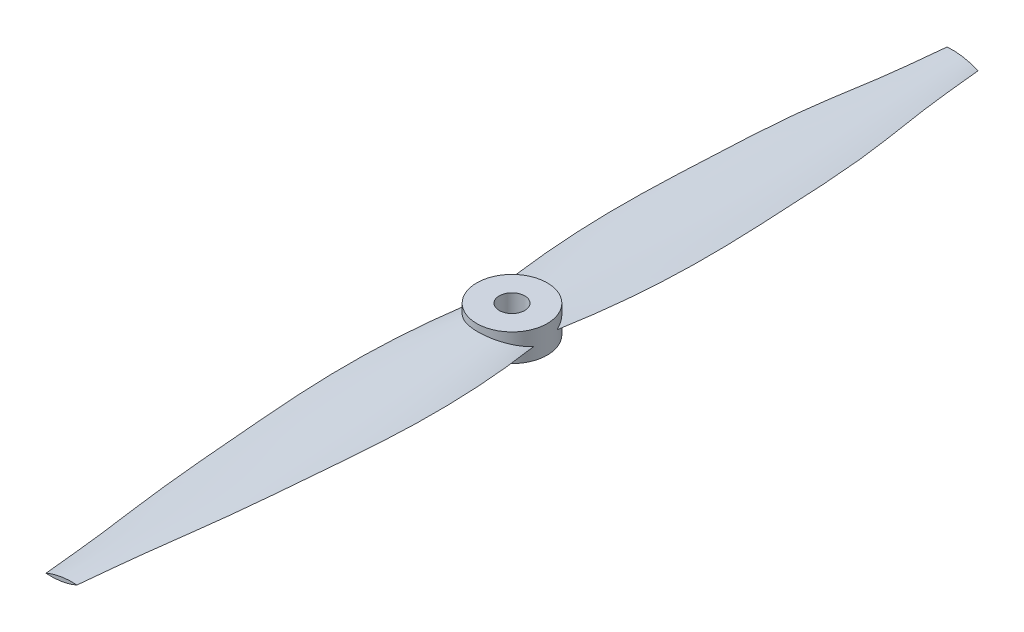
ISO-10303-21;
HEADER;
FILE_DESCRIPTION(('STEP AP214'),'2;1');
FILE_NAME('part.step','',(''),(''),'','','');
FILE_SCHEMA(('AUTOMOTIVE_DESIGN { 1 0 10303 214 1 1 1 1 }'));
ENDSEC;
DATA;
#1=APPLICATION_CONTEXT('core data for automotive mechanical design processes');
#2=APPLICATION_PROTOCOL_DEFINITION('international standard','automotive_design',2000,#1);
#3=PRODUCT_CONTEXT('',#1,'mechanical');
#4=PRODUCT('Part','Part','',(#3));
#5=PRODUCT_RELATED_PRODUCT_CATEGORY('part','',(#4));
#6=PRODUCT_DEFINITION_FORMATION('','',#4);
#7=PRODUCT_DEFINITION_CONTEXT('part definition',#1,'design');
#8=PRODUCT_DEFINITION('design','',#6,#7);
#9=PRODUCT_DEFINITION_SHAPE('','',#8);
#10=(LENGTH_UNIT() NAMED_UNIT(*) SI_UNIT(.MILLI.,.METRE.));
#11=(NAMED_UNIT(*) PLANE_ANGLE_UNIT() SI_UNIT($,.RADIAN.));
#12=(NAMED_UNIT(*) SI_UNIT($,.STERADIAN.) SOLID_ANGLE_UNIT());
#13=UNCERTAINTY_MEASURE_WITH_UNIT(LENGTH_MEASURE(1.E-05),#10,'distance_accuracy_value','');
#14=(GEOMETRIC_REPRESENTATION_CONTEXT(3) GLOBAL_UNCERTAINTY_ASSIGNED_CONTEXT((#13)) GLOBAL_UNIT_ASSIGNED_CONTEXT((#10,
#11,#12)) REPRESENTATION_CONTEXT('',''));
#15=CARTESIAN_POINT('',(0.,0.,0.));
#16=DIRECTION('',(0.,0.,1.));
#17=DIRECTION('',(1.,0.,0.));
#18=AXIS2_PLACEMENT_3D('',#15,#16,#17);
#19=CARTESIAN_POINT('',(0.,3.5,0.));
#20=DIRECTION('',(0.,-1.,0.));
#21=DIRECTION('',(0.,0.,-1.));
#22=AXIS2_PLACEMENT_3D('',#19,#20,#21);
#23=CYLINDRICAL_SURFACE('',#22,9.);
#24=CARTESIAN_POINT('',(8.49229536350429,0.370134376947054,-2.98008715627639));
#25=CARTESIAN_POINT('',(8.40599822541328,0.300246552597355,-3.22604159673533));
#26=CARTESIAN_POINT('',(8.30907946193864,0.229445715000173,-3.46799804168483));
#27=CARTESIAN_POINT('',(8.09474414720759,0.0870961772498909,-3.94243858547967));
#28=CARTESIAN_POINT('',(7.97732687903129,0.0155474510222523,-4.17492235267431));
#29=CARTESIAN_POINT('',(7.72240445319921,-0.127406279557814,-4.62953314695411));
#30=CARTESIAN_POINT('',(7.58484621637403,-0.198810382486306,-4.85163069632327));
#31=CARTESIAN_POINT('',(7.2907532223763,-0.340393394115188,-5.2832862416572));
#32=CARTESIAN_POINT('',(7.13421936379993,-0.410572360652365,-5.49284483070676));
#33=CARTESIAN_POINT('',(6.80296601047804,-0.548965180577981,-5.89815441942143));
#34=CARTESIAN_POINT('',(6.62822768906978,-0.617176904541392,-6.09389076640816));
#35=CARTESIAN_POINT('',(6.26179455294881,-0.75076898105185,-6.46983983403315));
#36=CARTESIAN_POINT('',(6.07010027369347,-0.816149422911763,-6.65005304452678));
#37=CARTESIAN_POINT('',(5.67149402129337,-0.94309378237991,-6.99307577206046));
#38=CARTESIAN_POINT('',(5.46462414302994,-1.00466744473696,-7.15593057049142));
#39=CARTESIAN_POINT('',(5.03662756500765,-1.12327590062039,-7.46336190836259));
#40=CARTESIAN_POINT('',(4.81550710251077,-1.18031265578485,-7.60794636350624));
#41=CARTESIAN_POINT('',(4.36871767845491,-1.28689198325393,-7.87269019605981));
#42=CARTESIAN_POINT('',(4.14351043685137,-1.3366322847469,-7.9935492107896));
#43=CARTESIAN_POINT('',(3.68243837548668,-1.43004093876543,-8.21615545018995));
#44=CARTESIAN_POINT('',(3.44656727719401,-1.47370565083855,-8.31789122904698));
#45=CARTESIAN_POINT('',(2.98310613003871,-1.55103213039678,-8.49459331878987));
#46=CARTESIAN_POINT('',(2.75612876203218,-1.58518572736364,-8.57095304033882));
#47=CARTESIAN_POINT('',(2.29584544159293,-1.64660267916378,-8.70554998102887));
#48=CARTESIAN_POINT('',(2.06253717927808,-1.67386348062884,-8.76378048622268));
#49=CARTESIAN_POINT('',(1.59133560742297,-1.72091276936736,-8.86146316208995));
#50=CARTESIAN_POINT('',(1.35344341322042,-1.74070305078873,-8.90091984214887));
#51=CARTESIAN_POINT('',(0.874853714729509,-1.77255405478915,-8.96062241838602));
#52=CARTESIAN_POINT('',(0.634157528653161,-1.78461827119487,-8.98087699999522));
#53=CARTESIAN_POINT('',(0.157346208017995,-1.80090894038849,-9.00171330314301));
#54=CARTESIAN_POINT('',(-0.0787432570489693,-1.80531334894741,-9.00274726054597));
#55=CARTESIAN_POINT('',(-0.550058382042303,-1.80716071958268,-8.98626629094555));
#56=CARTESIAN_POINT('',(-0.785284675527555,-1.80461074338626,-8.96877019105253));
#57=CARTESIAN_POINT('',(-1.25345886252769,-1.79306746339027,-8.91539947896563));
#58=CARTESIAN_POINT('',(-1.48640693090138,-1.78407465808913,-8.87952628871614));
#59=CARTESIAN_POINT('',(-1.94867532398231,-1.76024089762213,-8.78966186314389));
#60=CARTESIAN_POINT('',(-2.17799242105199,-1.74539501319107,-8.73565536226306));
#61=CARTESIAN_POINT('',(-2.63398854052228,-1.71029347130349,-8.60922419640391));
#62=CARTESIAN_POINT('',(-2.86060473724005,-1.68997619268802,-8.53659021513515));
#63=CARTESIAN_POINT('',(-3.30704334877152,-1.64465855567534,-8.37376510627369));
#64=CARTESIAN_POINT('',(-3.52686327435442,-1.61965650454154,-8.28356763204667));
#65=CARTESIAN_POINT('',(-3.95852774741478,-1.56554458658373,-8.08618866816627));
#66=CARTESIAN_POINT('',(-4.17036263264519,-1.53642993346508,-7.97898737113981));
#67=CARTESIAN_POINT('',(-4.58452382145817,-1.47465215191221,-7.74843972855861));
#68=CARTESIAN_POINT('',(-4.78684956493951,-1.44198881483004,-7.62509243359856));
#69=CARTESIAN_POINT('',(-5.18974083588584,-1.3720377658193,-7.3571556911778));
#70=CARTESIAN_POINT('',(-5.38980977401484,-1.3346074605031,-7.2118562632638));
#71=CARTESIAN_POINT('',(-5.77699560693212,-1.25687962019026,-6.90559597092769));
#72=CARTESIAN_POINT('',(-5.96411169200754,-1.21658190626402,-6.74463412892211));
#73=CARTESIAN_POINT('',(-6.32421237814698,-1.13358573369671,-6.40820174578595));
#74=CARTESIAN_POINT('',(-6.4971977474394,-1.09088740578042,-6.2327319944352));
#75=CARTESIAN_POINT('',(-6.82799076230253,-1.00355248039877,-5.86848080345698));
#76=CARTESIAN_POINT('',(-6.98579865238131,-0.958915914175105,-5.67969957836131));
#77=CARTESIAN_POINT('',(-7.28097300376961,-0.869505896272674,-5.29569455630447));
#78=CARTESIAN_POINT('',(-7.41879719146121,-0.824773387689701,-5.10081274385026));
#79=CARTESIAN_POINT('',(-7.67845858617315,-0.734456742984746,-4.70086405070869));
#80=CARTESIAN_POINT('',(-7.80029592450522,-0.688872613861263,-4.49579725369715));
#81=CARTESIAN_POINT('',(-8.02728047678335,-0.597437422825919,-4.07670677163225));
#82=CARTESIAN_POINT('',(-8.13242909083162,-0.55158638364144,-3.86268383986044));
#83=CARTESIAN_POINT('',(-8.32546085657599,-0.460338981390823,-3.42688806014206));
#84=CARTESIAN_POINT('',(-8.41334350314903,-0.414942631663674,-3.20511498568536));
#85=CARTESIAN_POINT('',(-8.49229623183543,-0.370137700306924,-2.9800846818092));
#86=B_SPLINE_CURVE_WITH_KNOTS('',3,(#24,#25,#26,#27,#28,#29,#30,#31,#32,#33,#34,#35,#36,#37,#38,
#39,#40,#41,#42,#43,#44,#45,#46,#47,#48,#49,#50,#51,#52,#53,#54,#55,#56,#57,#58,#59,#60,#61,#62,
#63,#64,#65,#66,#67,#68,#69,#70,#71,#72,#73,#74,#75,#76,#77,#78,#79,#80,#81,#82,#83,#84,#85),
.UNSPECIFIED.,.F.,.F.,(4,2,2,2,2,2,2,2,2,2,2,2,2,2,2,2,2,2,2,2,2,2,2,2,2,2,2,2,2,2,4),(0.,
0.809330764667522,1.61868984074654,2.43022161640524,3.24171497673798,4.0540560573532,
4.8663714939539,5.67651319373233,6.48630268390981,7.26649136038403,8.04714552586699,
8.77201532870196,9.49715326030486,10.2221169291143,10.9467525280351,11.6543162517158,
12.3611617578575,13.0679525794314,13.7753399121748,14.4910538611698,15.2070269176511,
15.9238402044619,16.6406956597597,17.3900838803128,18.1395189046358,18.8889131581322,
19.6382953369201,20.366101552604,21.0939017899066,21.821640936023,22.5494013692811),.UNSPECIFIED.);
#87=CARTESIAN_POINT('',(8.49229536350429,0.370134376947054,-2.9800871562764));
#88=VERTEX_POINT('',#87);
#89=CARTESIAN_POINT('',(-8.49229623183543,-0.370137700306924,-2.9800846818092));
#90=VERTEX_POINT('',#89);
#91=EDGE_CURVE('E182',#88,#90,#86,.T.);
#92=ORIENTED_EDGE('',*,*,#91,.F.);
#93=CARTESIAN_POINT('',(-8.49229623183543,-0.370137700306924,-2.9800846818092));
#94=CARTESIAN_POINT('',(-8.40599913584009,-0.300250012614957,-3.2260392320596));
#95=CARTESIAN_POINT('',(-8.30908040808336,-0.229449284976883,-3.46799578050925));
#96=CARTESIAN_POINT('',(-8.09474515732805,-0.0870999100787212,-3.94243651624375));
#97=CARTESIAN_POINT('',(-7.97732791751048,-0.0155512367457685,-4.17492037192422));
#98=CARTESIAN_POINT('',(-7.72240554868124,0.127402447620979,-4.62953132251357));
#99=CARTESIAN_POINT('',(-7.5848473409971,0.198806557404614,-4.8516289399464));
#100=CARTESIAN_POINT('',(-7.2907544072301,0.340389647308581,-5.28328460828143));
#101=CARTESIAN_POINT('',(-7.13422057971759,0.41056868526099,-5.49284325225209));
#102=CARTESIAN_POINT('',(-6.80296729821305,0.548961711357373,-5.89815293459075));
#103=CARTESIAN_POINT('',(-6.62822901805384,0.617173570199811,-6.09388932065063));
#104=CARTESIAN_POINT('',(-6.26179597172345,0.750765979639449,-6.46983846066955));
#105=CARTESIAN_POINT('',(-6.07010174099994,0.816146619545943,-6.6500517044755));
#106=CARTESIAN_POINT('',(-5.67149558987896,0.943091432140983,-6.99307449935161));
#107=CARTESIAN_POINT('',(-5.46462576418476,1.00466534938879,-7.15592933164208));
#108=CARTESIAN_POINT('',(-5.03662929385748,1.1232743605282,-7.46336074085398));
#109=CARTESIAN_POINT('',(-4.81550888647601,1.1803114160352,-7.60794523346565));
#110=CARTESIAN_POINT('',(-4.36871943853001,1.28689139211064,-7.87268922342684));
#111=CARTESIAN_POINT('',(-4.14351211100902,1.33663203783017,-7.99354834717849));
#112=CARTESIAN_POINT('',(-3.68243985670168,1.4300413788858,-8.21615479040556));
#113=CARTESIAN_POINT('',(-3.44656865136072,1.47370643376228,-8.31789066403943));
#114=CARTESIAN_POINT('',(-2.98310753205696,1.55103350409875,-8.49459282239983));
#115=CARTESIAN_POINT('',(-2.75613030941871,1.58518735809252,-8.57095253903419));
#116=CARTESIAN_POINT('',(-2.29584727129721,1.64660479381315,-8.70554949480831));
#117=CARTESIAN_POINT('',(-2.06253914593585,1.67386582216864,-8.76378002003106));
#118=CARTESIAN_POINT('',(-1.59133783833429,1.72091551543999,-8.86146275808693));
#119=CARTESIAN_POINT('',(-1.35344577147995,1.74070597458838,-8.90091948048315));
#120=CARTESIAN_POINT('',(-0.874856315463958,1.7725572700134,-8.96062216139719));
#121=CARTESIAN_POINT('',(-0.634160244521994,1.78462160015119,-8.98087680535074));
#122=CARTESIAN_POINT('',(-0.157349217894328,1.80091241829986,-9.00171324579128));
#123=CARTESIAN_POINT('',(0.0787400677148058,1.80531686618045,-9.00274728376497));
#124=CARTESIAN_POINT('',(0.550054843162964,1.80716424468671,-8.98626650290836));
#125=CARTESIAN_POINT('',(0.785280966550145,1.80461423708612,-8.96877051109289));
#126=CARTESIAN_POINT('',(1.25345482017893,1.79307082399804,-8.91540004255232));
#127=CARTESIAN_POINT('',(1.48640272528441,1.78407791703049,-8.87952698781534));
#128=CARTESIAN_POINT('',(1.94867079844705,1.76024388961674,-8.78966286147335));
#129=CARTESIAN_POINT('',(2.17798773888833,1.74539783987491,-8.73565652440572));
#130=CARTESIAN_POINT('',(2.63398354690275,1.71029591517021,-8.60922571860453));
#131=CARTESIAN_POINT('',(2.86059958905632,1.68997841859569,-8.53659193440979));
#132=CARTESIAN_POINT('',(3.30703790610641,1.64466031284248,-8.37376724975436));
#133=CARTESIAN_POINT('',(3.52685769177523,1.61965801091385,-8.28357000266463));
#134=CARTESIAN_POINT('',(3.95852190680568,1.56554557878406,-8.08619152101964));
#135=CARTESIAN_POINT('',(4.17035667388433,1.53643066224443,-7.97899047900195));
#136=CARTESIAN_POINT('',(4.58451765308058,1.474652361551,-7.7484433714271));
#137=CARTESIAN_POINT('',(4.78684330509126,1.44198876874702,-7.62509635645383));
#138=CARTESIAN_POINT('',(5.18973457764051,1.3720371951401,-7.35716010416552));
#139=CARTESIAN_POINT('',(5.38980360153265,1.3346066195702,-7.21186087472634));
#140=CARTESIAN_POINT('',(5.77698962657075,1.25687827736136,-6.90560097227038));
#141=CARTESIAN_POINT('',(5.96410581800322,1.21658033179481,-6.7446393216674));
#142=CARTESIAN_POINT('',(6.32420673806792,1.13358374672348,-6.40820731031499));
#143=CARTESIAN_POINT('',(6.49719223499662,1.09088523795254,-6.23273773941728));
#144=CARTESIAN_POINT('',(6.82798552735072,1.0035500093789,-5.86848689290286));
#145=CARTESIAN_POINT('',(6.98579356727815,0.958913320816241,-5.67970583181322));
#146=CARTESIAN_POINT('',(7.28096851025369,0.869503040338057,-5.29570075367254));
#147=CARTESIAN_POINT('',(7.41879311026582,0.824770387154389,-5.10081870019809));
#148=CARTESIAN_POINT('',(7.6784552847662,0.734453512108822,-4.70086946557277));
#149=CARTESIAN_POINT('',(7.80029299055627,0.688869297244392,-4.49580236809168));
#150=CARTESIAN_POINT('',(8.02727822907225,0.59743399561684,-4.07671122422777));
#151=CARTESIAN_POINT('',(8.1324271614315,0.551582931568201,-3.86268793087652));
#152=CARTESIAN_POINT('',(8.32545950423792,0.460335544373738,-3.4268913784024));
#153=CARTESIAN_POINT('',(8.41334240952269,0.414939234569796,-3.20511789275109));
#154=CARTESIAN_POINT('',(8.49229536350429,0.370134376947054,-2.98008715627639));
#155=B_SPLINE_CURVE_WITH_KNOTS('',3,(#93,#94,#95,#96,#97,#98,#99,#100,#101,#102,#103,#104,#105,
#106,#107,#108,#109,#110,#111,#112,#113,#114,#115,#116,#117,#118,#119,#120,#121,#122,#123,#124,
#125,#126,#127,#128,#129,#130,#131,#132,#133,#134,#135,#136,#137,#138,#139,#140,#141,#142,#143,
#144,#145,#146,#147,#148,#149,#150,#151,#152,#153,#154),.UNSPECIFIED.,.F.,.F.,(4,2,2,2,2,2,2,2,
2,2,2,2,2,2,2,2,2,2,2,2,2,2,2,2,2,2,2,2,2,2,4),(0.,0.809330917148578,1.61869014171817,
2.43022204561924,3.24171553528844,4.05405672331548,4.86637226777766,5.67651408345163,
6.4863036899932,7.26649293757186,8.04714767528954,8.77201717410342,9.49715480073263,
10.2221181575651,10.9467534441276,11.6543166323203,12.3611616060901,13.0679518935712,
13.7753386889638,14.4910520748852,15.2070245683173,15.9238372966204,16.6406921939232,
17.3900803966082,18.1395154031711,18.8889096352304,19.6382917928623,20.3660993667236,
21.0939009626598,21.8216414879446,22.5494033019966),.UNSPECIFIED.);
#156=EDGE_CURVE('E157',#90,#88,#155,.T.);
#157=ORIENTED_EDGE('',*,*,#156,.F.);
#158=EDGE_LOOP('',(#92,#157));
#159=FACE_BOUND('',#158,.T.);
#160=CARTESIAN_POINT('',(-8.49229536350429,0.370134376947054,2.98008715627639));
#161=CARTESIAN_POINT('',(-8.40599822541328,0.300246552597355,3.22604159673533));
#162=CARTESIAN_POINT('',(-8.30907946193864,0.229445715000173,3.46799804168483));
#163=CARTESIAN_POINT('',(-8.09474414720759,0.0870961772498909,3.94243858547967));
#164=CARTESIAN_POINT('',(-7.97732687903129,0.0155474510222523,4.17492235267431));
#165=CARTESIAN_POINT('',(-7.72240445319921,-0.127406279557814,4.62953314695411));
#166=CARTESIAN_POINT('',(-7.58484621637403,-0.198810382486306,4.85163069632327));
#167=CARTESIAN_POINT('',(-7.2907532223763,-0.340393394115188,5.2832862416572));
#168=CARTESIAN_POINT('',(-7.13421936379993,-0.410572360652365,5.49284483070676));
#169=CARTESIAN_POINT('',(-6.80296601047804,-0.548965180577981,5.89815441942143));
#170=CARTESIAN_POINT('',(-6.62822768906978,-0.617176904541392,6.09389076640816));
#171=CARTESIAN_POINT('',(-6.26179455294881,-0.75076898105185,6.46983983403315));
#172=CARTESIAN_POINT('',(-6.07010027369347,-0.816149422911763,6.65005304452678));
#173=CARTESIAN_POINT('',(-5.67149402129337,-0.94309378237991,6.99307577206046));
#174=CARTESIAN_POINT('',(-5.46462414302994,-1.00466744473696,7.15593057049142));
#175=CARTESIAN_POINT('',(-5.03662756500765,-1.12327590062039,7.46336190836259));
#176=CARTESIAN_POINT('',(-4.81550710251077,-1.18031265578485,7.60794636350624));
#177=CARTESIAN_POINT('',(-4.36871767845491,-1.28689198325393,7.87269019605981));
#178=CARTESIAN_POINT('',(-4.14351043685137,-1.3366322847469,7.9935492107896));
#179=CARTESIAN_POINT('',(-3.68243837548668,-1.43004093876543,8.21615545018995));
#180=CARTESIAN_POINT('',(-3.44656727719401,-1.47370565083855,8.31789122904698));
#181=CARTESIAN_POINT('',(-2.98310613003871,-1.55103213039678,8.49459331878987));
#182=CARTESIAN_POINT('',(-2.75612876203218,-1.58518572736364,8.57095304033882));
#183=CARTESIAN_POINT('',(-2.29584544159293,-1.64660267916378,8.70554998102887));
#184=CARTESIAN_POINT('',(-2.06253717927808,-1.67386348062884,8.76378048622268));
#185=CARTESIAN_POINT('',(-1.59133560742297,-1.72091276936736,8.86146316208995));
#186=CARTESIAN_POINT('',(-1.35344341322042,-1.74070305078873,8.90091984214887));
#187=CARTESIAN_POINT('',(-0.874853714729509,-1.77255405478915,8.96062241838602));
#188=CARTESIAN_POINT('',(-0.634157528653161,-1.78461827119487,8.98087699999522));
#189=CARTESIAN_POINT('',(-0.157346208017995,-1.80090894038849,9.00171330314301));
#190=CARTESIAN_POINT('',(0.0787432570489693,-1.80531334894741,9.00274726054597));
#191=CARTESIAN_POINT('',(0.550058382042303,-1.80716071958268,8.98626629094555));
#192=CARTESIAN_POINT('',(0.785284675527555,-1.80461074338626,8.96877019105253));
#193=CARTESIAN_POINT('',(1.25345886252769,-1.79306746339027,8.91539947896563));
#194=CARTESIAN_POINT('',(1.48640693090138,-1.78407465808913,8.87952628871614));
#195=CARTESIAN_POINT('',(1.94867532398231,-1.76024089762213,8.78966186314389));
#196=CARTESIAN_POINT('',(2.17799242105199,-1.74539501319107,8.73565536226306));
#197=CARTESIAN_POINT('',(2.63398854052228,-1.71029347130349,8.60922419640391));
#198=CARTESIAN_POINT('',(2.86060473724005,-1.68997619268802,8.53659021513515));
#199=CARTESIAN_POINT('',(3.30704334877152,-1.64465855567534,8.37376510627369));
#200=CARTESIAN_POINT('',(3.52686327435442,-1.61965650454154,8.28356763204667));
#201=CARTESIAN_POINT('',(3.95852774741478,-1.56554458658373,8.08618866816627));
#202=CARTESIAN_POINT('',(4.17036263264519,-1.53642993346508,7.97898737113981));
#203=CARTESIAN_POINT('',(4.58452382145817,-1.47465215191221,7.74843972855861));
#204=CARTESIAN_POINT('',(4.78684956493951,-1.44198881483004,7.62509243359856));
#205=CARTESIAN_POINT('',(5.18974083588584,-1.3720377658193,7.3571556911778));
#206=CARTESIAN_POINT('',(5.38980977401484,-1.3346074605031,7.2118562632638));
#207=CARTESIAN_POINT('',(5.77699560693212,-1.25687962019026,6.90559597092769));
#208=CARTESIAN_POINT('',(5.96411169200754,-1.21658190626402,6.74463412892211));
#209=CARTESIAN_POINT('',(6.32421237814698,-1.13358573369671,6.40820174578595));
#210=CARTESIAN_POINT('',(6.4971977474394,-1.09088740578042,6.2327319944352));
#211=CARTESIAN_POINT('',(6.82799076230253,-1.00355248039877,5.86848080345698));
#212=CARTESIAN_POINT('',(6.98579865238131,-0.958915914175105,5.67969957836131));
#213=CARTESIAN_POINT('',(7.28097300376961,-0.869505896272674,5.29569455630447));
#214=CARTESIAN_POINT('',(7.41879719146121,-0.824773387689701,5.10081274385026));
#215=CARTESIAN_POINT('',(7.67845858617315,-0.734456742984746,4.70086405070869));
#216=CARTESIAN_POINT('',(7.80029592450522,-0.688872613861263,4.49579725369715));
#217=CARTESIAN_POINT('',(8.02728047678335,-0.597437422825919,4.07670677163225));
#218=CARTESIAN_POINT('',(8.13242909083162,-0.55158638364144,3.86268383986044));
#219=CARTESIAN_POINT('',(8.32546085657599,-0.460338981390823,3.42688806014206));
#220=CARTESIAN_POINT('',(8.41334350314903,-0.414942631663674,3.20511498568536));
#221=CARTESIAN_POINT('',(8.49229623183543,-0.370137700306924,2.9800846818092));
#222=B_SPLINE_CURVE_WITH_KNOTS('',3,(#160,#161,#162,#163,#164,#165,#166,#167,#168,#169,#170,
#171,#172,#173,#174,#175,#176,#177,#178,#179,#180,#181,#182,#183,#184,#185,#186,#187,#188,#189,
#190,#191,#192,#193,#194,#195,#196,#197,#198,#199,#200,#201,#202,#203,#204,#205,#206,#207,#208,
#209,#210,#211,#212,#213,#214,#215,#216,#217,#218,#219,#220,#221),.UNSPECIFIED.,.F.,.F.,(4,2,2,
2,2,2,2,2,2,2,2,2,2,2,2,2,2,2,2,2,2,2,2,2,2,2,2,2,2,2,4),(0.,0.809330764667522,1.61868984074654,
2.43022161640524,3.24171497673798,4.0540560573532,4.8663714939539,5.67651319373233,
6.48630268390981,7.26649136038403,8.04714552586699,8.77201532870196,9.49715326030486,
10.2221169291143,10.9467525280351,11.6543162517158,12.3611617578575,13.0679525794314,
13.7753399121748,14.4910538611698,15.2070269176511,15.9238402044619,16.6406956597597,
17.3900838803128,18.1395189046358,18.8889131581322,19.6382953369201,20.366101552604,
21.0939017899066,21.821640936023,22.5494013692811),.UNSPECIFIED.);
#223=CARTESIAN_POINT('',(-8.49229536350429,0.370134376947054,2.98008715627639));
#224=VERTEX_POINT('',#223);
#225=CARTESIAN_POINT('',(8.49229623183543,-0.370137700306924,2.9800846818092));
#226=VERTEX_POINT('',#225);
#227=EDGE_CURVE('E164',#224,#226,#222,.T.);
#228=ORIENTED_EDGE('',*,*,#227,.F.);
#229=CARTESIAN_POINT('',(8.49229623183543,-0.370137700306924,2.9800846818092));
#230=CARTESIAN_POINT('',(8.40599913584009,-0.300250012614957,3.2260392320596));
#231=CARTESIAN_POINT('',(8.30908040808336,-0.229449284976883,3.46799578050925));
#232=CARTESIAN_POINT('',(8.09474515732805,-0.0870999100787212,3.94243651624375));
#233=CARTESIAN_POINT('',(7.97732791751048,-0.0155512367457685,4.17492037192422));
#234=CARTESIAN_POINT('',(7.72240554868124,0.127402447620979,4.62953132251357));
#235=CARTESIAN_POINT('',(7.5848473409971,0.198806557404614,4.8516289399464));
#236=CARTESIAN_POINT('',(7.2907544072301,0.340389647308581,5.28328460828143));
#237=CARTESIAN_POINT('',(7.13422057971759,0.41056868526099,5.49284325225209));
#238=CARTESIAN_POINT('',(6.80296729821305,0.548961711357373,5.89815293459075));
#239=CARTESIAN_POINT('',(6.62822901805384,0.617173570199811,6.09388932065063));
#240=CARTESIAN_POINT('',(6.26179597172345,0.750765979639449,6.46983846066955));
#241=CARTESIAN_POINT('',(6.07010174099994,0.816146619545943,6.6500517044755));
#242=CARTESIAN_POINT('',(5.67149558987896,0.943091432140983,6.99307449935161));
#243=CARTESIAN_POINT('',(5.46462576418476,1.00466534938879,7.15592933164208));
#244=CARTESIAN_POINT('',(5.03662929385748,1.1232743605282,7.46336074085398));
#245=CARTESIAN_POINT('',(4.81550888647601,1.1803114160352,7.60794523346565));
#246=CARTESIAN_POINT('',(4.36871943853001,1.28689139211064,7.87268922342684));
#247=CARTESIAN_POINT('',(4.14351211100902,1.33663203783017,7.99354834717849));
#248=CARTESIAN_POINT('',(3.68243985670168,1.4300413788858,8.21615479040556));
#249=CARTESIAN_POINT('',(3.44656865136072,1.47370643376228,8.31789066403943));
#250=CARTESIAN_POINT('',(2.98310753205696,1.55103350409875,8.49459282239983));
#251=CARTESIAN_POINT('',(2.75613030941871,1.58518735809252,8.57095253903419));
#252=CARTESIAN_POINT('',(2.29584727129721,1.64660479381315,8.70554949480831));
#253=CARTESIAN_POINT('',(2.06253914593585,1.67386582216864,8.76378002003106));
#254=CARTESIAN_POINT('',(1.59133783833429,1.72091551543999,8.86146275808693));
#255=CARTESIAN_POINT('',(1.35344577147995,1.74070597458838,8.90091948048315));
#256=CARTESIAN_POINT('',(0.874856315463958,1.7725572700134,8.96062216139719));
#257=CARTESIAN_POINT('',(0.634160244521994,1.78462160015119,8.98087680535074));
#258=CARTESIAN_POINT('',(0.157349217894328,1.80091241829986,9.00171324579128));
#259=CARTESIAN_POINT('',(-0.0787400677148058,1.80531686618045,9.00274728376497));
#260=CARTESIAN_POINT('',(-0.550054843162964,1.80716424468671,8.98626650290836));
#261=CARTESIAN_POINT('',(-0.785280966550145,1.80461423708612,8.96877051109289));
#262=CARTESIAN_POINT('',(-1.25345482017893,1.79307082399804,8.91540004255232));
#263=CARTESIAN_POINT('',(-1.48640272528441,1.78407791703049,8.87952698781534));
#264=CARTESIAN_POINT('',(-1.94867079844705,1.76024388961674,8.78966286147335));
#265=CARTESIAN_POINT('',(-2.17798773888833,1.74539783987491,8.73565652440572));
#266=CARTESIAN_POINT('',(-2.63398354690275,1.71029591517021,8.60922571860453));
#267=CARTESIAN_POINT('',(-2.86059958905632,1.68997841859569,8.53659193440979));
#268=CARTESIAN_POINT('',(-3.30703790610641,1.64466031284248,8.37376724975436));
#269=CARTESIAN_POINT('',(-3.52685769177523,1.61965801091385,8.28357000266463));
#270=CARTESIAN_POINT('',(-3.95852190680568,1.56554557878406,8.08619152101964));
#271=CARTESIAN_POINT('',(-4.17035667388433,1.53643066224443,7.97899047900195));
#272=CARTESIAN_POINT('',(-4.58451765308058,1.474652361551,7.7484433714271));
#273=CARTESIAN_POINT('',(-4.78684330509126,1.44198876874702,7.62509635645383));
#274=CARTESIAN_POINT('',(-5.18973457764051,1.3720371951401,7.35716010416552));
#275=CARTESIAN_POINT('',(-5.38980360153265,1.3346066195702,7.21186087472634));
#276=CARTESIAN_POINT('',(-5.77698962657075,1.25687827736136,6.90560097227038));
#277=CARTESIAN_POINT('',(-5.96410581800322,1.21658033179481,6.7446393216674));
#278=CARTESIAN_POINT('',(-6.32420673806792,1.13358374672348,6.40820731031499));
#279=CARTESIAN_POINT('',(-6.49719223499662,1.09088523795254,6.23273773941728));
#280=CARTESIAN_POINT('',(-6.82798552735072,1.0035500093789,5.86848689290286));
#281=CARTESIAN_POINT('',(-6.98579356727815,0.958913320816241,5.67970583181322));
#282=CARTESIAN_POINT('',(-7.28096851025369,0.869503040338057,5.29570075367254));
#283=CARTESIAN_POINT('',(-7.41879311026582,0.824770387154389,5.10081870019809));
#284=CARTESIAN_POINT('',(-7.6784552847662,0.734453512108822,4.70086946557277));
#285=CARTESIAN_POINT('',(-7.80029299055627,0.688869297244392,4.49580236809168));
#286=CARTESIAN_POINT('',(-8.02727822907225,0.59743399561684,4.07671122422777));
#287=CARTESIAN_POINT('',(-8.1324271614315,0.551582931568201,3.86268793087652));
#288=CARTESIAN_POINT('',(-8.32545950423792,0.460335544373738,3.4268913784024));
#289=CARTESIAN_POINT('',(-8.41334240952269,0.414939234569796,3.20511789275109));
#290=CARTESIAN_POINT('',(-8.49229536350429,0.370134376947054,2.98008715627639));
#291=B_SPLINE_CURVE_WITH_KNOTS('',3,(#229,#230,#231,#232,#233,#234,#235,#236,#237,#238,#239,
#240,#241,#242,#243,#244,#245,#246,#247,#248,#249,#250,#251,#252,#253,#254,#255,#256,#257,#258,
#259,#260,#261,#262,#263,#264,#265,#266,#267,#268,#269,#270,#271,#272,#273,#274,#275,#276,#277,
#278,#279,#280,#281,#282,#283,#284,#285,#286,#287,#288,#289,#290),.UNSPECIFIED.,.F.,.F.,(4,2,2,
2,2,2,2,2,2,2,2,2,2,2,2,2,2,2,2,2,2,2,2,2,2,2,2,2,2,2,4),(0.,0.809330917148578,1.61869014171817,
2.43022204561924,3.24171553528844,4.05405672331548,4.86637226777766,5.67651408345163,
6.4863036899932,7.26649293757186,8.04714767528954,8.77201717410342,9.49715480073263,
10.2221181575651,10.9467534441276,11.6543166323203,12.3611616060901,13.0679518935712,
13.7753386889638,14.4910520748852,15.2070245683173,15.9238372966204,16.6406921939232,
17.3900803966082,18.1395154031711,18.8889096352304,19.6382917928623,20.3660993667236,
21.0939009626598,21.8216414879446,22.5494033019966),.UNSPECIFIED.);
#292=EDGE_CURVE('E13',#226,#224,#291,.T.);
#293=ORIENTED_EDGE('',*,*,#292,.F.);
#294=EDGE_LOOP('',(#228,#293));
#295=FACE_BOUND('',#294,.T.);
#296=CARTESIAN_POINT('',(0.,3.5,0.));
#297=DIRECTION('',(0.,1.,0.));
#298=DIRECTION('',(0.,0.,1.));
#299=AXIS2_PLACEMENT_3D('',#296,#297,#298);
#300=CIRCLE('',#299,9.);
#301=CARTESIAN_POINT('',(0.,3.5,9.));
#302=VERTEX_POINT('',#301);
#303=EDGE_CURVE('E270',#302,#302,#300,.T.);
#304=ORIENTED_EDGE('',*,*,#303,.F.);
#305=EDGE_LOOP('',(#304));
#306=FACE_BOUND('',#305,.T.);
#307=CARTESIAN_POINT('',(0.,-3.5,0.));
#308=DIRECTION('',(0.,1.,0.));
#309=DIRECTION('',(0.,0.,1.));
#310=AXIS2_PLACEMENT_3D('',#307,#308,#309);
#311=CIRCLE('',#310,9.);
#312=CARTESIAN_POINT('',(0.,-3.5,9.));
#313=VERTEX_POINT('',#312);
#314=EDGE_CURVE('E198',#313,#313,#311,.T.);
#315=ORIENTED_EDGE('',*,*,#314,.T.);
#316=EDGE_LOOP('',(#315));
#317=FACE_BOUND('',#316,.T.);
#318=ADVANCED_FACE('F136',(#159,#295,#306,#317),#23,.T.);
#319=CARTESIAN_POINT('',(0.,3.5,0.));
#320=DIRECTION('',(0.,1.,0.));
#321=DIRECTION('',(0.,0.,1.));
#322=AXIS2_PLACEMENT_3D('',#319,#320,#321);
#323=PLANE('',#322);
#324=CARTESIAN_POINT('',(0.,3.5,0.));
#325=DIRECTION('',(0.,1.,0.));
#326=DIRECTION('',(0.,0.,1.));
#327=AXIS2_PLACEMENT_3D('',#324,#325,#326);
#328=CIRCLE('',#327,3.25);
#329=CARTESIAN_POINT('',(0.,3.5,3.25));
#330=VERTEX_POINT('',#329);
#331=EDGE_CURVE('E398',#330,#330,#328,.T.);
#332=ORIENTED_EDGE('',*,*,#331,.F.);
#333=EDGE_LOOP('',(#332));
#334=FACE_BOUND('',#333,.T.);
#335=ORIENTED_EDGE('',*,*,#303,.T.);
#336=EDGE_LOOP('',(#335));
#337=FACE_BOUND('',#336,.T.);
#338=ADVANCED_FACE('F222',(#334,#337),#323,.T.);
#339=CARTESIAN_POINT('',(0.,-3.5,0.));
#340=DIRECTION('',(0.,1.,0.));
#341=DIRECTION('',(0.,0.,1.));
#342=AXIS2_PLACEMENT_3D('',#339,#340,#341);
#343=PLANE('',#342);
#344=CARTESIAN_POINT('',(0.,-3.5,0.));
#345=DIRECTION('',(0.,1.,0.));
#346=DIRECTION('',(0.,0.,1.));
#347=AXIS2_PLACEMENT_3D('',#344,#345,#346);
#348=CIRCLE('',#347,3.25);
#349=CARTESIAN_POINT('',(0.,-3.5,3.25));
#350=VERTEX_POINT('',#349);
#351=EDGE_CURVE('E189',#350,#350,#348,.T.);
#352=ORIENTED_EDGE('',*,*,#351,.T.);
#353=EDGE_LOOP('',(#352));
#354=FACE_BOUND('',#353,.T.);
#355=ORIENTED_EDGE('',*,*,#314,.F.);
#356=EDGE_LOOP('',(#355));
#357=FACE_BOUND('',#356,.T.);
#358=ADVANCED_FACE('F255',(#354,#357),#343,.F.);
#359=CARTESIAN_POINT('',(-7.98950767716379,0.40959379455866,0.));
#360=CARTESIAN_POINT('',(-12.0561668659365,0.110375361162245,23.0680854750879));
#361=CARTESIAN_POINT('',(-8.02240751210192,-1.47553311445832,97.8627216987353));
#362=CARTESIAN_POINT('',(-7.05800765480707,-0.63358085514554,82.8203774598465));
#363=CARTESIAN_POINT('',(-3.9443883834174,-0.664680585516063,115.));
#364=CARTESIAN_POINT('',(-3.23737777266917,-2.49818943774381,0.));
#365=CARTESIAN_POINT('',(1.10690236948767,-2.29852613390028,6.1112617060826));
#366=CARTESIAN_POINT('',(-9.15990210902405,-1.04799999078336,43.9098888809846));
#367=CARTESIAN_POINT('',(-0.365829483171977,-1.19853823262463,89.1923383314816));
#368=CARTESIAN_POINT('',(-1.25866726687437,-0.887844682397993,115.));
#369=CARTESIAN_POINT('',(2.96492987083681,-2.81615953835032,0.));
#370=CARTESIAN_POINT('',(-1.31143785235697,-2.41604595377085,6.11126011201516));
#371=CARTESIAN_POINT('',(9.24141521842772,-1.12916032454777,43.9098926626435));
#372=CARTESIAN_POINT('',(0.511653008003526,-0.260279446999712,89.1923354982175));
#373=CARTESIAN_POINT('',(1.48010994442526,-0.426261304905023,115.));
#374=CARTESIAN_POINT('',(7.98950767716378,-0.409593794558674,0.));
#375=CARTESIAN_POINT('',(12.0561777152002,-0.110403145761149,23.0680863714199));
#376=CARTESIAN_POINT('',(8.02236353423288,1.4756457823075,97.8627179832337));
#377=CARTESIAN_POINT('',(7.05807523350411,0.633407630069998,82.8203831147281));
#378=CARTESIAN_POINT('',(3.94438838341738,0.664680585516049,115.));
#379=B_SPLINE_SURFACE_WITH_KNOTS('',3,3,((#359,#360,#361,#362,#363),(#364,#365,#366,#367,#368),
(#369,#370,#371,#372,#373),(#374,#375,#376,#377,#378)),.UNSPECIFIED.,.F.,.F.,.F.,(4,4),(4,1,4),
(0.,1.),(0.,0.235060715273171,1.),.UNSPECIFIED.);
#380=CARTESIAN_POINT('',(-7.98950767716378,0.40959379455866,0.));
#381=CARTESIAN_POINT('',(-12.0561668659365,0.110375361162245,23.0680854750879));
#382=CARTESIAN_POINT('',(-8.02240751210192,-1.47553311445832,97.8627216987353));
#383=CARTESIAN_POINT('',(-7.05800765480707,-0.63358085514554,82.8203774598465));
#384=CARTESIAN_POINT('',(-3.9443883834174,-0.664680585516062,115.));
#385=B_SPLINE_CURVE_WITH_KNOTS('',3,(#380,#381,#382,#383,#384),.UNSPECIFIED.,.F.,.F.,(4,1,4),
(0.,0.235060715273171,1.),.UNSPECIFIED.);
#386=CARTESIAN_POINT('',(-3.9443883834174,-0.664680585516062,115.));
#387=VERTEX_POINT('',#386);
#388=EDGE_CURVE('E269',#224,#387,#385,.T.);
#389=CARTESIAN_POINT('',(7.98950767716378,-0.409593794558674,0.));
#390=CARTESIAN_POINT('',(12.0561777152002,-0.110403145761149,23.0680863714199));
#391=CARTESIAN_POINT('',(8.02236353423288,1.4756457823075,97.8627179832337));
#392=CARTESIAN_POINT('',(7.05807523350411,0.633407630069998,82.8203831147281));
#393=CARTESIAN_POINT('',(3.94438838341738,0.664680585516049,115.));
#394=B_SPLINE_CURVE_WITH_KNOTS('',3,(#389,#390,#391,#392,#393),.UNSPECIFIED.,.F.,.F.,(4,1,4),
(0.,0.235060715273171,1.),.UNSPECIFIED.);
#395=CARTESIAN_POINT('',(3.94438838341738,0.664680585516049,115.));
#396=VERTEX_POINT('',#395);
#397=EDGE_CURVE('E292',#396,#226,#394,.F.);
#398=CARTESIAN_POINT('',(-3.9443883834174,-0.664680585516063,114.999999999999));
#399=CARTESIAN_POINT('',(-3.41487908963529,-0.708697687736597,115.000000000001));
#400=CARTESIAN_POINT('',(-2.88316909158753,-0.726073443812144,115.000000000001));
#401=CARTESIAN_POINT('',(-1.82096256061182,-0.70842247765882,115.));
#402=CARTESIAN_POINT('',(-1.2904654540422,-0.67343078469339,115.));
#403=CARTESIAN_POINT('',(-0.362252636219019,-0.56656573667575,115.));
#404=CARTESIAN_POINT('',(0.0367534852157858,-0.505568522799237,115.));
#405=CARTESIAN_POINT('',(0.829134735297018,-0.354237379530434,115.));
#406=CARTESIAN_POINT('',(1.22251059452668,-0.263907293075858,115.));
#407=CARTESIAN_POINT('',(2.01043490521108,-0.0518586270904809,115.));
#408=CARTESIAN_POINT('',(2.40480210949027,0.0705342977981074,115.));
#409=CARTESIAN_POINT('',(3.18307379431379,0.345257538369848,115.));
#410=CARTESIAN_POINT('',(3.56697561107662,0.497595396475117,115.));
#411=CARTESIAN_POINT('',(3.94438838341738,0.664680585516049,115.));
#412=B_SPLINE_CURVE_WITH_KNOTS('',3,(#398,#399,#400,#401,#402,#403,#404,#405,#406,#407,#408,
#409,#410,#411),.UNSPECIFIED.,.F.,.F.,(4,2,2,2,2,2,4),(0.,1.59336744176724,3.18566953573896,
4.39555156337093,5.60527514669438,6.84283101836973,8.08069900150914),.UNSPECIFIED.);
#413=EDGE_CURVE('E286',#387,#396,#412,.T.);
#414=ORIENTED_EDGE('',*,*,#388,.F.);
#415=ORIENTED_EDGE('',*,*,#227,.T.);
#416=ORIENTED_EDGE('',*,*,#397,.F.);
#417=ORIENTED_EDGE('',*,*,#413,.F.);
#418=EDGE_LOOP('',(#414,#415,#416,#417));
#419=FACE_BOUND('',#418,.T.);
#420=ADVANCED_FACE('F274',(#419),#379,.T.);
#421=CARTESIAN_POINT('',(7.98950767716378,-0.409593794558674,0.));
#422=CARTESIAN_POINT('',(12.0561777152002,-0.110403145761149,23.0680863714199));
#423=CARTESIAN_POINT('',(8.02236353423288,1.4756457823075,97.8627179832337));
#424=CARTESIAN_POINT('',(7.05807523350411,0.633407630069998,82.8203831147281));
#425=CARTESIAN_POINT('',(3.94438838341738,0.664680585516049,115.));
#426=CARTESIAN_POINT('',(3.23737777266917,2.49818943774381,0.));
#427=CARTESIAN_POINT('',(-1.10690961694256,2.29854469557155,6.11126011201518));
#428=CARTESIAN_POINT('',(9.15992193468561,1.04794919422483,43.9098926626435));
#429=CARTESIAN_POINT('',(0.365811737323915,1.19858371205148,89.1923354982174));
#430=CARTESIAN_POINT('',(1.25866726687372,0.887844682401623,115.));
#431=CARTESIAN_POINT('',(-2.96492987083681,2.81615953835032,0.));
#432=CARTESIAN_POINT('',(1.31143060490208,2.41606451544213,6.11126170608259));
#433=CARTESIAN_POINT('',(-9.24139539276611,1.12910952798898,43.9098888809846));
#434=CARTESIAN_POINT('',(-0.511670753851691,0.260324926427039,89.1923383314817));
#435=CARTESIAN_POINT('',(-1.48010994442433,0.426261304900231,115.));
#436=CARTESIAN_POINT('',(-7.98950767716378,0.40959379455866,0.));
#437=CARTESIAN_POINT('',(-12.0561668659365,0.110375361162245,23.0680854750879));
#438=CARTESIAN_POINT('',(-8.02240751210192,-1.47553311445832,97.8627216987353));
#439=CARTESIAN_POINT('',(-7.05800765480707,-0.63358085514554,82.8203774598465));
#440=CARTESIAN_POINT('',(-3.9443883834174,-0.664680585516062,115.));
#441=B_SPLINE_SURFACE_WITH_KNOTS('',3,3,((#421,#422,#423,#424,#425),(#426,#427,#428,#429,#430),
(#431,#432,#433,#434,#435),(#436,#437,#438,#439,#440)),.UNSPECIFIED.,.F.,.F.,.F.,(4,4),(4,1,4),
(0.,1.),(0.,0.235060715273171,1.),.UNSPECIFIED.);
#442=CARTESIAN_POINT('',(3.94438838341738,0.664680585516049,115.));
#443=CARTESIAN_POINT('',(3.41487877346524,0.708697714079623,115.000000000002));
#444=CARTESIAN_POINT('',(2.88316845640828,0.726073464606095,115.000000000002));
#445=CARTESIAN_POINT('',(1.82096129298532,0.708422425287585,115.));
#446=CARTESIAN_POINT('',(1.29046387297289,0.673430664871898,114.999999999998));
#447=CARTESIAN_POINT('',(0.362250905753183,0.566565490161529,115.));
#448=CARTESIAN_POINT('',(-0.0367550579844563,0.505568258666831,115.000000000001));
#449=CARTESIAN_POINT('',(-0.829135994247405,0.354237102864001,115.000000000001));
#450=CARTESIAN_POINT('',(-1.22251169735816,0.263907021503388,114.999999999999));
#451=CARTESIAN_POINT('',(-2.01043568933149,0.0518583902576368,114.999999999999));
#452=CARTESIAN_POINT('',(-2.40480273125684,-0.0705345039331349,115.));
#453=CARTESIAN_POINT('',(-3.18307409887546,-0.345257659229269,115.000000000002));
#454=CARTESIAN_POINT('',(-3.56697576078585,-0.497595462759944,115.000000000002));
#455=CARTESIAN_POINT('',(-3.9443883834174,-0.664680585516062,114.999999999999));
#456=B_SPLINE_CURVE_WITH_KNOTS('',3,(#442,#443,#444,#445,#446,#447,#448,#449,#450,#451,#452,
#453,#454,#455),.UNSPECIFIED.,.F.,.F.,(4,2,2,2,2,2,4),(0.,1.59336839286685,3.18567143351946,
4.3955530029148,5.60527612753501,6.8428315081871,8.0806990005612),.UNSPECIFIED.);
#457=EDGE_CURVE('E150',#396,#387,#456,.T.);
#458=ORIENTED_EDGE('',*,*,#397,.T.);
#459=ORIENTED_EDGE('',*,*,#292,.T.);
#460=ORIENTED_EDGE('',*,*,#388,.T.);
#461=ORIENTED_EDGE('',*,*,#457,.F.);
#462=EDGE_LOOP('',(#458,#459,#460,#461));
#463=FACE_BOUND('',#462,.T.);
#464=ADVANCED_FACE('F258',(#463),#441,.T.);
#465=CARTESIAN_POINT('',(-4.68916328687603,-1.4059667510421,115.000000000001));
#466=DIRECTION('',(3.03859893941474E-13,-1.03810643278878E-12,1.));
#467=DIRECTION('',(0.986097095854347,0.166170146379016,-1.27133061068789E-13));
#468=AXIS2_PLACEMENT_3D('',#465,#466,#467);
#469=PLANE('',#468);
#470=ORIENTED_EDGE('',*,*,#413,.T.);
#471=ORIENTED_EDGE('',*,*,#457,.T.);
#472=EDGE_LOOP('',(#470,#471));
#473=FACE_BOUND('',#472,.T.);
#474=ADVANCED_FACE('F138',(#473),#469,.T.);
#475=CARTESIAN_POINT('',(4.68916328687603,-1.4059667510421,-115.000000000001));
#476=DIRECTION('',(-3.03859893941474E-13,-1.03810643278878E-12,-1.));
#477=DIRECTION('',(-0.986097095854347,0.166170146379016,1.27133061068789E-13));
#478=AXIS2_PLACEMENT_3D('',#475,#476,#477);
#479=PLANE('',#478);
#480=CARTESIAN_POINT('',(3.9443883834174,-0.664680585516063,-114.999999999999));
#481=CARTESIAN_POINT('',(3.41487908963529,-0.708697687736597,-115.000000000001));
#482=CARTESIAN_POINT('',(2.88316909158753,-0.726073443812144,-115.000000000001));
#483=CARTESIAN_POINT('',(1.82096256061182,-0.70842247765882,-115.));
#484=CARTESIAN_POINT('',(1.2904654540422,-0.67343078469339,-115.));
#485=CARTESIAN_POINT('',(0.362252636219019,-0.56656573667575,-115.));
#486=CARTESIAN_POINT('',(-0.0367534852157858,-0.505568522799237,-115.));
#487=CARTESIAN_POINT('',(-0.829134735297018,-0.354237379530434,-115.));
#488=CARTESIAN_POINT('',(-1.22251059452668,-0.263907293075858,-115.));
#489=CARTESIAN_POINT('',(-2.01043490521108,-0.0518586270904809,-115.));
#490=CARTESIAN_POINT('',(-2.40480210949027,0.0705342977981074,-115.));
#491=CARTESIAN_POINT('',(-3.18307379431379,0.345257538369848,-115.));
#492=CARTESIAN_POINT('',(-3.56697561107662,0.497595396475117,-115.));
#493=CARTESIAN_POINT('',(-3.94438838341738,0.664680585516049,-115.));
#494=B_SPLINE_CURVE_WITH_KNOTS('',3,(#480,#481,#482,#483,#484,#485,#486,#487,#488,#489,#490,
#491,#492,#493),.UNSPECIFIED.,.F.,.F.,(4,2,2,2,2,2,4),(0.,1.59336744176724,3.18566953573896,
4.39555156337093,5.60527514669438,6.84283101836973,8.08069900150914),.UNSPECIFIED.);
#495=CARTESIAN_POINT('',(3.9443883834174,-0.664680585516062,-115.));
#496=VERTEX_POINT('',#495);
#497=CARTESIAN_POINT('',(-3.94438838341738,0.664680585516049,-115.));
#498=VERTEX_POINT('',#497);
#499=EDGE_CURVE('E195',#496,#498,#494,.T.);
#500=ORIENTED_EDGE('',*,*,#499,.T.);
#501=CARTESIAN_POINT('',(-3.94438838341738,0.664680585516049,-115.));
#502=CARTESIAN_POINT('',(-3.41487877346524,0.708697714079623,-115.000000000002));
#503=CARTESIAN_POINT('',(-2.88316845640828,0.726073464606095,-115.000000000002));
#504=CARTESIAN_POINT('',(-1.82096129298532,0.708422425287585,-115.));
#505=CARTESIAN_POINT('',(-1.29046387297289,0.673430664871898,-114.999999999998));
#506=CARTESIAN_POINT('',(-0.362250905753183,0.566565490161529,-115.));
#507=CARTESIAN_POINT('',(0.0367550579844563,0.505568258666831,-115.000000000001));
#508=CARTESIAN_POINT('',(0.829135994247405,0.354237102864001,-115.000000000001));
#509=CARTESIAN_POINT('',(1.22251169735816,0.263907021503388,-114.999999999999));
#510=CARTESIAN_POINT('',(2.01043568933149,0.0518583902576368,-114.999999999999));
#511=CARTESIAN_POINT('',(2.40480273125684,-0.0705345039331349,-115.));
#512=CARTESIAN_POINT('',(3.18307409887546,-0.345257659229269,-115.000000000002));
#513=CARTESIAN_POINT('',(3.56697576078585,-0.497595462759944,-115.000000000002));
#514=CARTESIAN_POINT('',(3.9443883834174,-0.664680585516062,-114.999999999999));
#515=B_SPLINE_CURVE_WITH_KNOTS('',3,(#501,#502,#503,#504,#505,#506,#507,#508,#509,#510,#511,
#512,#513,#514),.UNSPECIFIED.,.F.,.F.,(4,2,2,2,2,2,4),(0.,1.59336839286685,3.18567143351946,
4.3955530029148,5.60527612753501,6.8428315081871,8.0806990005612),.UNSPECIFIED.);
#516=EDGE_CURVE('E194',#498,#496,#515,.T.);
#517=ORIENTED_EDGE('',*,*,#516,.T.);
#518=EDGE_LOOP('',(#500,#517));
#519=FACE_BOUND('',#518,.T.);
#520=ADVANCED_FACE('F220',(#519),#479,.T.);
#521=CARTESIAN_POINT('',(-7.98950767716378,-0.409593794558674,0.));
#522=CARTESIAN_POINT('',(-12.0561777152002,-0.110403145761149,-23.0680863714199));
#523=CARTESIAN_POINT('',(-8.02236353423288,1.4756457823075,-97.8627179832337));
#524=CARTESIAN_POINT('',(-7.05807523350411,0.633407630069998,-82.8203831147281));
#525=CARTESIAN_POINT('',(-3.94438838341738,0.664680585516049,-115.));
#526=CARTESIAN_POINT('',(-3.23737777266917,2.49818943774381,0.));
#527=CARTESIAN_POINT('',(1.10690961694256,2.29854469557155,-6.11126011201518));
#528=CARTESIAN_POINT('',(-9.15992193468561,1.04794919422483,-43.9098926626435));
#529=CARTESIAN_POINT('',(-0.365811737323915,1.19858371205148,-89.1923354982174));
#530=CARTESIAN_POINT('',(-1.25866726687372,0.887844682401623,-115.));
#531=CARTESIAN_POINT('',(2.96492987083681,2.81615953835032,0.));
#532=CARTESIAN_POINT('',(-1.31143060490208,2.41606451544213,-6.11126170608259));
#533=CARTESIAN_POINT('',(9.24139539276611,1.12910952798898,-43.9098888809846));
#534=CARTESIAN_POINT('',(0.511670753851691,0.260324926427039,-89.1923383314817));
#535=CARTESIAN_POINT('',(1.48010994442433,0.426261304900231,-115.));
#536=CARTESIAN_POINT('',(7.98950767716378,0.40959379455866,0.));
#537=CARTESIAN_POINT('',(12.0561668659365,0.110375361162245,-23.0680854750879));
#538=CARTESIAN_POINT('',(8.02240751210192,-1.47553311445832,-97.8627216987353));
#539=CARTESIAN_POINT('',(7.05800765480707,-0.63358085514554,-82.8203774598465));
#540=CARTESIAN_POINT('',(3.9443883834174,-0.664680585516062,-115.));
#541=B_SPLINE_SURFACE_WITH_KNOTS('',3,3,((#521,#522,#523,#524,#525),(#526,#527,#528,#529,#530),
(#531,#532,#533,#534,#535),(#536,#537,#538,#539,#540)),.UNSPECIFIED.,.F.,.F.,.F.,(4,4),(4,1,4),
(0.,1.),(0.,0.235060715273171,1.),.UNSPECIFIED.);
#542=CARTESIAN_POINT('',(-7.98950767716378,-0.409593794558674,0.));
#543=CARTESIAN_POINT('',(-12.0561777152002,-0.110403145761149,-23.0680863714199));
#544=CARTESIAN_POINT('',(-8.02236353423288,1.4756457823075,-97.8627179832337));
#545=CARTESIAN_POINT('',(-7.05807523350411,0.633407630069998,-82.8203831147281));
#546=CARTESIAN_POINT('',(-3.94438838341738,0.664680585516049,-115.));
#547=B_SPLINE_CURVE_WITH_KNOTS('',3,(#542,#543,#544,#545,#546),.UNSPECIFIED.,.F.,.F.,(4,1,4),
(0.,0.235060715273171,1.),.UNSPECIFIED.);
#548=EDGE_CURVE('E185',#498,#90,#547,.F.);
#549=CARTESIAN_POINT('',(7.98950767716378,0.40959379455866,0.));
#550=CARTESIAN_POINT('',(12.0561668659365,0.110375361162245,-23.0680854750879));
#551=CARTESIAN_POINT('',(8.02240751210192,-1.47553311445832,-97.8627216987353));
#552=CARTESIAN_POINT('',(7.05800765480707,-0.63358085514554,-82.8203774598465));
#553=CARTESIAN_POINT('',(3.9443883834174,-0.664680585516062,-115.));
#554=B_SPLINE_CURVE_WITH_KNOTS('',3,(#549,#550,#551,#552,#553),.UNSPECIFIED.,.F.,.F.,(4,1,4),
(0.,0.235060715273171,1.),.UNSPECIFIED.);
#555=EDGE_CURVE('E187',#88,#496,#554,.T.);
#556=ORIENTED_EDGE('',*,*,#548,.T.);
#557=ORIENTED_EDGE('',*,*,#156,.T.);
#558=ORIENTED_EDGE('',*,*,#555,.T.);
#559=ORIENTED_EDGE('',*,*,#516,.F.);
#560=EDGE_LOOP('',(#556,#557,#558,#559));
#561=FACE_BOUND('',#560,.T.);
#562=ADVANCED_FACE('F192',(#561),#541,.T.);
#563=CARTESIAN_POINT('',(7.98950767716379,0.40959379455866,0.));
#564=CARTESIAN_POINT('',(12.0561668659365,0.110375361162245,-23.0680854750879));
#565=CARTESIAN_POINT('',(8.02240751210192,-1.47553311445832,-97.8627216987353));
#566=CARTESIAN_POINT('',(7.05800765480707,-0.63358085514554,-82.8203774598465));
#567=CARTESIAN_POINT('',(3.9443883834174,-0.664680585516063,-115.));
#568=CARTESIAN_POINT('',(3.23737777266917,-2.49818943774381,0.));
#569=CARTESIAN_POINT('',(-1.10690236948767,-2.29852613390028,-6.1112617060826));
#570=CARTESIAN_POINT('',(9.15990210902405,-1.04799999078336,-43.9098888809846));
#571=CARTESIAN_POINT('',(0.365829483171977,-1.19853823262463,-89.1923383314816));
#572=CARTESIAN_POINT('',(1.25866726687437,-0.887844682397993,-115.));
#573=CARTESIAN_POINT('',(-2.96492987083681,-2.81615953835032,0.));
#574=CARTESIAN_POINT('',(1.31143785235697,-2.41604595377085,-6.11126011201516));
#575=CARTESIAN_POINT('',(-9.24141521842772,-1.12916032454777,-43.9098926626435));
#576=CARTESIAN_POINT('',(-0.511653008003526,-0.260279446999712,-89.1923354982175));
#577=CARTESIAN_POINT('',(-1.48010994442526,-0.426261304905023,-115.));
#578=CARTESIAN_POINT('',(-7.98950767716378,-0.409593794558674,0.));
#579=CARTESIAN_POINT('',(-12.0561777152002,-0.110403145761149,-23.0680863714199));
#580=CARTESIAN_POINT('',(-8.02236353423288,1.4756457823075,-97.8627179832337));
#581=CARTESIAN_POINT('',(-7.05807523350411,0.633407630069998,-82.8203831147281));
#582=CARTESIAN_POINT('',(-3.94438838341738,0.664680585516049,-115.));
#583=B_SPLINE_SURFACE_WITH_KNOTS('',3,3,((#563,#564,#565,#566,#567),(#568,#569,#570,#571,#572),
(#573,#574,#575,#576,#577),(#578,#579,#580,#581,#582)),.UNSPECIFIED.,.F.,.F.,.F.,(4,4),(4,1,4),
(0.,1.),(0.,0.235060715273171,1.),.UNSPECIFIED.);
#584=ORIENTED_EDGE('',*,*,#555,.F.);
#585=ORIENTED_EDGE('',*,*,#91,.T.);
#586=ORIENTED_EDGE('',*,*,#548,.F.);
#587=ORIENTED_EDGE('',*,*,#499,.F.);
#588=EDGE_LOOP('',(#584,#585,#586,#587));
#589=FACE_BOUND('',#588,.T.);
#590=ADVANCED_FACE('F183',(#589),#583,.T.);
#591=CARTESIAN_POINT('',(0.,-3.5,0.));
#592=DIRECTION('',(0.,1.,0.));
#593=DIRECTION('',(0.,0.,1.));
#594=AXIS2_PLACEMENT_3D('',#591,#592,#593);
#595=CYLINDRICAL_SURFACE('',#594,3.25);
#596=ORIENTED_EDGE('',*,*,#351,.F.);
#597=EDGE_LOOP('',(#596));
#598=FACE_BOUND('',#597,.T.);
#599=ORIENTED_EDGE('',*,*,#331,.T.);
#600=EDGE_LOOP('',(#599));
#601=FACE_BOUND('',#600,.T.);
#602=ADVANCED_FACE('F238',(#598,#601),#595,.F.);
#603=CLOSED_SHELL('',(#318,#338,#358,#420,#464,#474,#520,#562,#590,#602));
#604=MANIFOLD_SOLID_BREP('B2',#603);
#605=ADVANCED_BREP_SHAPE_REPRESENTATION('',(#18,#604),#14);
#606=SHAPE_DEFINITION_REPRESENTATION(#9,#605);
ENDSEC;
END-ISO-10303-21;
